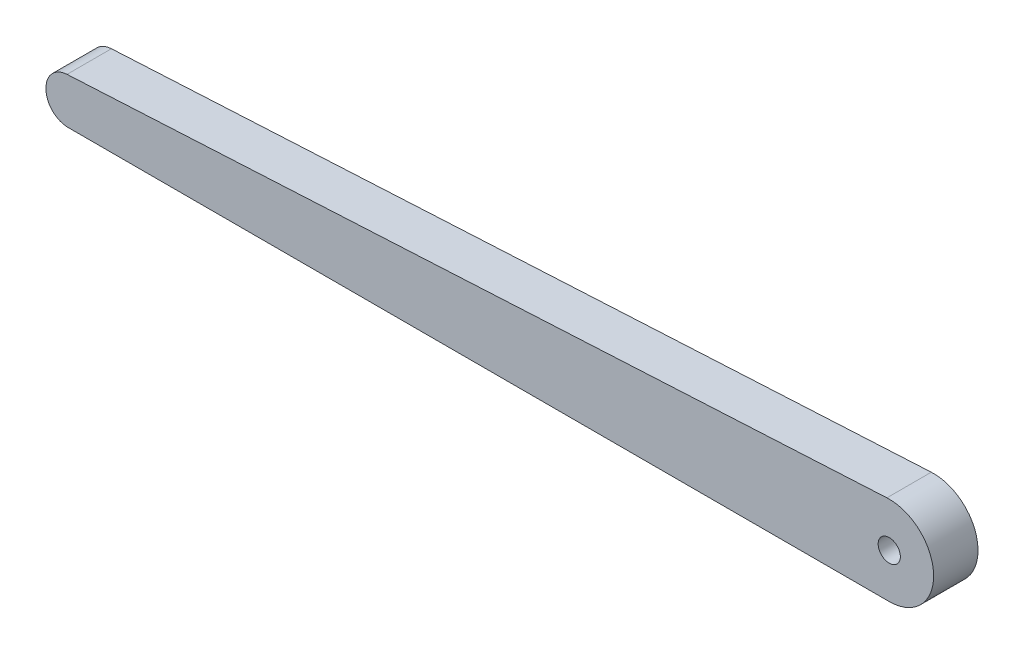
ISO-10303-21;
HEADER;
FILE_DESCRIPTION(('STEP AP214'),'2;1');
FILE_NAME('part.step','',(''),(''),'','','');
FILE_SCHEMA(('AUTOMOTIVE_DESIGN { 1 0 10303 214 1 1 1 1 }'));
ENDSEC;
DATA;
#1=APPLICATION_CONTEXT('core data for automotive mechanical design processes');
#2=APPLICATION_PROTOCOL_DEFINITION('international standard','automotive_design',2000,#1);
#3=PRODUCT_CONTEXT('',#1,'mechanical');
#4=PRODUCT('Part','Part','',(#3));
#5=PRODUCT_RELATED_PRODUCT_CATEGORY('part','',(#4));
#6=PRODUCT_DEFINITION_FORMATION('','',#4);
#7=PRODUCT_DEFINITION_CONTEXT('part definition',#1,'design');
#8=PRODUCT_DEFINITION('design','',#6,#7);
#9=PRODUCT_DEFINITION_SHAPE('','',#8);
#10=(LENGTH_UNIT() NAMED_UNIT(*) SI_UNIT(.MILLI.,.METRE.));
#11=(NAMED_UNIT(*) PLANE_ANGLE_UNIT() SI_UNIT($,.RADIAN.));
#12=(NAMED_UNIT(*) SI_UNIT($,.STERADIAN.) SOLID_ANGLE_UNIT());
#13=UNCERTAINTY_MEASURE_WITH_UNIT(LENGTH_MEASURE(1.E-05),#10,'distance_accuracy_value','');
#14=(GEOMETRIC_REPRESENTATION_CONTEXT(3) GLOBAL_UNCERTAINTY_ASSIGNED_CONTEXT((#13)) GLOBAL_UNIT_ASSIGNED_CONTEXT((#10,
#11,#12)) REPRESENTATION_CONTEXT('',''));
#15=CARTESIAN_POINT('',(0.,0.,0.));
#16=DIRECTION('',(0.,0.,1.));
#17=DIRECTION('',(1.,0.,0.));
#18=AXIS2_PLACEMENT_3D('',#15,#16,#17);
#19=CARTESIAN_POINT('',(0.,0.,1.));
#20=DIRECTION('',(0.,0.,1.));
#21=DIRECTION('',(1.,0.,0.));
#22=AXIS2_PLACEMENT_3D('',#19,#20,#21);
#23=PLANE('',#22);
#24=CARTESIAN_POINT('',(0.,0.,1.));
#25=DIRECTION('',(0.,0.,1.));
#26=DIRECTION('',(1.,0.,0.));
#27=AXIS2_PLACEMENT_3D('',#24,#25,#26);
#28=CIRCLE('',#27,2.);
#29=CARTESIAN_POINT('',(0.,-2.,1.));
#30=VERTEX_POINT('',#29);
#31=CARTESIAN_POINT('',(-0.105263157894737,1.99722799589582,1.));
#32=VERTEX_POINT('',#31);
#33=EDGE_CURVE('E129',#30,#32,#28,.T.);
#34=ORIENTED_EDGE('',*,*,#33,.T.);
#35=DIRECTION('',(-0.998613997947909,-0.0526315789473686,0.));
#36=VECTOR('',#35,1.);
#37=CARTESIAN_POINT('',(-37.0526315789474,0.0499306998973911,1.));
#38=LINE('',#37,#36);
#39=CARTESIAN_POINT('',(-37.0526315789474,0.0499306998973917,1.));
#40=VERTEX_POINT('',#39);
#41=EDGE_CURVE('E87',#32,#40,#38,.T.);
#42=ORIENTED_EDGE('',*,*,#41,.T.);
#43=CARTESIAN_POINT('',(-37.,-0.948683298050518,1.));
#44=DIRECTION('',(0.,0.,1.));
#45=DIRECTION('',(1.,0.,0.));
#46=AXIS2_PLACEMENT_3D('',#43,#44,#45);
#47=CIRCLE('',#46,1.);
#48=CARTESIAN_POINT('',(-38.,-0.948683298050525,1.));
#49=VERTEX_POINT('',#48);
#50=EDGE_CURVE('E100',#40,#49,#47,.T.);
#51=ORIENTED_EDGE('',*,*,#50,.T.);
#52=DIRECTION('',(0.,-1.,0.));
#53=VECTOR('',#52,1.);
#54=CARTESIAN_POINT('',(-38.,-0.999999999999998,1.));
#55=LINE('',#54,#53);
#56=CARTESIAN_POINT('',(-38.,-0.999999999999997,1.));
#57=VERTEX_POINT('',#56);
#58=EDGE_CURVE('E94',#49,#57,#55,.T.);
#59=ORIENTED_EDGE('',*,*,#58,.T.);
#60=CARTESIAN_POINT('',(-37.,-1.,1.));
#61=DIRECTION('',(0.,0.,1.));
#62=DIRECTION('',(-1.,0.,0.));
#63=AXIS2_PLACEMENT_3D('',#60,#61,#62);
#64=CIRCLE('',#63,1.);
#65=CARTESIAN_POINT('',(-37.,-2.,1.));
#66=VERTEX_POINT('',#65);
#67=EDGE_CURVE('E98',#57,#66,#64,.T.);
#68=ORIENTED_EDGE('',*,*,#67,.T.);
#69=DIRECTION('',(1.,0.,0.));
#70=VECTOR('',#69,1.);
#71=CARTESIAN_POINT('',(0.,-2.,1.));
#72=LINE('',#71,#70);
#73=EDGE_CURVE('E50',#66,#30,#72,.T.);
#74=ORIENTED_EDGE('',*,*,#73,.T.);
#75=EDGE_LOOP('',(#34,#42,#51,#59,#68,#74));
#76=FACE_BOUND('',#75,.T.);
#77=CARTESIAN_POINT('',(0.,0.,1.));
#78=DIRECTION('',(0.,0.,1.));
#79=DIRECTION('',(1.,0.,0.));
#80=AXIS2_PLACEMENT_3D('',#77,#78,#79);
#81=CIRCLE('',#80,0.5);
#82=CARTESIAN_POINT('',(0.5,0.,1.));
#83=VERTEX_POINT('',#82);
#84=EDGE_CURVE('E122',#83,#83,#81,.T.);
#85=ORIENTED_EDGE('',*,*,#84,.F.);
#86=EDGE_LOOP('',(#85));
#87=FACE_BOUND('',#86,.T.);
#88=ADVANCED_FACE('F33',(#76,#87),#23,.T.);
#89=CARTESIAN_POINT('',(0.,0.,-1.));
#90=DIRECTION('',(0.,0.,1.));
#91=DIRECTION('',(1.,0.,0.));
#92=AXIS2_PLACEMENT_3D('',#89,#90,#91);
#93=PLANE('',#92);
#94=CARTESIAN_POINT('',(0.,0.,-1.));
#95=DIRECTION('',(0.,0.,1.));
#96=DIRECTION('',(1.,0.,0.));
#97=AXIS2_PLACEMENT_3D('',#94,#95,#96);
#98=CIRCLE('',#97,2.);
#99=CARTESIAN_POINT('',(0.,-2.,-1.));
#100=VERTEX_POINT('',#99);
#101=CARTESIAN_POINT('',(-0.105263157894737,1.99722799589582,-1.));
#102=VERTEX_POINT('',#101);
#103=EDGE_CURVE('E118',#100,#102,#98,.T.);
#104=ORIENTED_EDGE('',*,*,#103,.F.);
#105=DIRECTION('',(1.,0.,0.));
#106=VECTOR('',#105,1.);
#107=CARTESIAN_POINT('',(0.,-2.,-1.));
#108=LINE('',#107,#106);
#109=CARTESIAN_POINT('',(-37.,-2.,-1.));
#110=VERTEX_POINT('',#109);
#111=EDGE_CURVE('E79',#110,#100,#108,.T.);
#112=ORIENTED_EDGE('',*,*,#111,.F.);
#113=CARTESIAN_POINT('',(-37.,-1.,-1.));
#114=DIRECTION('',(0.,0.,1.));
#115=DIRECTION('',(-1.,0.,0.));
#116=AXIS2_PLACEMENT_3D('',#113,#114,#115);
#117=CIRCLE('',#116,1.);
#118=CARTESIAN_POINT('',(-38.,-0.999999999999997,-1.));
#119=VERTEX_POINT('',#118);
#120=EDGE_CURVE('E73',#119,#110,#117,.T.);
#121=ORIENTED_EDGE('',*,*,#120,.F.);
#122=DIRECTION('',(0.,-1.,0.));
#123=VECTOR('',#122,1.);
#124=CARTESIAN_POINT('',(-38.,-0.999999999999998,-1.));
#125=LINE('',#124,#123);
#126=CARTESIAN_POINT('',(-38.,-0.948683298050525,-1.));
#127=VERTEX_POINT('',#126);
#128=EDGE_CURVE('E108',#127,#119,#125,.T.);
#129=ORIENTED_EDGE('',*,*,#128,.F.);
#130=CARTESIAN_POINT('',(-37.,-0.948683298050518,-1.));
#131=DIRECTION('',(0.,0.,1.));
#132=DIRECTION('',(1.,0.,0.));
#133=AXIS2_PLACEMENT_3D('',#130,#131,#132);
#134=CIRCLE('',#133,1.);
#135=CARTESIAN_POINT('',(-37.0526315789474,0.0499306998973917,-1.));
#136=VERTEX_POINT('',#135);
#137=EDGE_CURVE('E124',#136,#127,#134,.T.);
#138=ORIENTED_EDGE('',*,*,#137,.F.);
#139=DIRECTION('',(-0.998613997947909,-0.0526315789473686,0.));
#140=VECTOR('',#139,1.);
#141=CARTESIAN_POINT('',(-37.0526315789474,0.0499306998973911,-1.));
#142=LINE('',#141,#140);
#143=EDGE_CURVE('E121',#102,#136,#142,.T.);
#144=ORIENTED_EDGE('',*,*,#143,.F.);
#145=EDGE_LOOP('',(#104,#112,#121,#129,#138,#144));
#146=FACE_BOUND('',#145,.T.);
#147=CARTESIAN_POINT('',(0.,0.,-1.));
#148=DIRECTION('',(0.,0.,1.));
#149=DIRECTION('',(1.,0.,0.));
#150=AXIS2_PLACEMENT_3D('',#147,#148,#149);
#151=CIRCLE('',#150,0.5);
#152=CARTESIAN_POINT('',(0.5,0.,-1.));
#153=VERTEX_POINT('',#152);
#154=EDGE_CURVE('E222',#153,#153,#151,.T.);
#155=ORIENTED_EDGE('',*,*,#154,.T.);
#156=EDGE_LOOP('',(#155));
#157=FACE_BOUND('',#156,.T.);
#158=ADVANCED_FACE('F138',(#146,#157),#93,.F.);
#159=CARTESIAN_POINT('',(0.,0.,1.));
#160=DIRECTION('',(0.,0.,-1.));
#161=DIRECTION('',(-1.,0.,0.));
#162=AXIS2_PLACEMENT_3D('',#159,#160,#161);
#163=CYLINDRICAL_SURFACE('',#162,2.);
#164=ORIENTED_EDGE('',*,*,#103,.T.);
#165=DIRECTION('',(0.,0.,-1.));
#166=VECTOR('',#165,1.);
#167=CARTESIAN_POINT('',(-0.105263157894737,1.99722799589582,1.));
#168=LINE('',#167,#166);
#169=EDGE_CURVE('E11',#32,#102,#168,.T.);
#170=ORIENTED_EDGE('',*,*,#169,.F.);
#171=ORIENTED_EDGE('',*,*,#33,.F.);
#172=DIRECTION('',(0.,0.,-1.));
#173=VECTOR('',#172,1.);
#174=CARTESIAN_POINT('',(0.,-2.,1.));
#175=LINE('',#174,#173);
#176=EDGE_CURVE('E114',#30,#100,#175,.T.);
#177=ORIENTED_EDGE('',*,*,#176,.T.);
#178=EDGE_LOOP('',(#164,#170,#171,#177));
#179=FACE_BOUND('',#178,.T.);
#180=ADVANCED_FACE('F35',(#179),#163,.T.);
#181=CARTESIAN_POINT('',(-37.0526315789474,0.0499306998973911,1.));
#182=DIRECTION('',(0.0526315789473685,-0.998613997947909,0.));
#183=DIRECTION('',(0.998613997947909,0.0526315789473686,0.));
#184=AXIS2_PLACEMENT_3D('',#181,#182,#183);
#185=PLANE('',#184);
#186=ORIENTED_EDGE('',*,*,#143,.T.);
#187=DIRECTION('',(0.,0.,-1.));
#188=VECTOR('',#187,1.);
#189=CARTESIAN_POINT('',(-37.0526315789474,0.0499306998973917,1.));
#190=LINE('',#189,#188);
#191=EDGE_CURVE('E42',#40,#136,#190,.T.);
#192=ORIENTED_EDGE('',*,*,#191,.F.);
#193=ORIENTED_EDGE('',*,*,#41,.F.);
#194=ORIENTED_EDGE('',*,*,#169,.T.);
#195=EDGE_LOOP('',(#186,#192,#193,#194));
#196=FACE_BOUND('',#195,.T.);
#197=ADVANCED_FACE('F163',(#196),#185,.F.);
#198=CARTESIAN_POINT('',(-37.,-0.948683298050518,1.));
#199=DIRECTION('',(0.,0.,-1.));
#200=DIRECTION('',(-1.,0.,0.));
#201=AXIS2_PLACEMENT_3D('',#198,#199,#200);
#202=CYLINDRICAL_SURFACE('',#201,1.);
#203=ORIENTED_EDGE('',*,*,#137,.T.);
#204=DIRECTION('',(0.,0.,-1.));
#205=VECTOR('',#204,1.);
#206=CARTESIAN_POINT('',(-38.,-0.948683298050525,1.));
#207=LINE('',#206,#205);
#208=EDGE_CURVE('E109',#49,#127,#207,.T.);
#209=ORIENTED_EDGE('',*,*,#208,.F.);
#210=ORIENTED_EDGE('',*,*,#50,.F.);
#211=ORIENTED_EDGE('',*,*,#191,.T.);
#212=EDGE_LOOP('',(#203,#209,#210,#211));
#213=FACE_BOUND('',#212,.T.);
#214=ADVANCED_FACE('F135',(#213),#202,.T.);
#215=CARTESIAN_POINT('',(-38.,-0.999999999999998,1.));
#216=DIRECTION('',(1.,0.,0.));
#217=DIRECTION('',(0.,0.,-1.));
#218=AXIS2_PLACEMENT_3D('',#215,#216,#217);
#219=PLANE('',#218);
#220=ORIENTED_EDGE('',*,*,#128,.T.);
#221=DIRECTION('',(0.,0.,-1.));
#222=VECTOR('',#221,1.);
#223=CARTESIAN_POINT('',(-38.,-0.999999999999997,1.));
#224=LINE('',#223,#222);
#225=EDGE_CURVE('E105',#57,#119,#224,.T.);
#226=ORIENTED_EDGE('',*,*,#225,.F.);
#227=ORIENTED_EDGE('',*,*,#58,.F.);
#228=ORIENTED_EDGE('',*,*,#208,.T.);
#229=EDGE_LOOP('',(#220,#226,#227,#228));
#230=FACE_BOUND('',#229,.T.);
#231=ADVANCED_FACE('F106',(#230),#219,.F.);
#232=CARTESIAN_POINT('',(-37.,-1.,1.));
#233=DIRECTION('',(0.,0.,-1.));
#234=DIRECTION('',(-1.,0.,0.));
#235=AXIS2_PLACEMENT_3D('',#232,#233,#234);
#236=CYLINDRICAL_SURFACE('',#235,1.);
#237=ORIENTED_EDGE('',*,*,#120,.T.);
#238=DIRECTION('',(0.,0.,-1.));
#239=VECTOR('',#238,1.);
#240=CARTESIAN_POINT('',(-37.,-2.,1.));
#241=LINE('',#240,#239);
#242=EDGE_CURVE('E110',#66,#110,#241,.T.);
#243=ORIENTED_EDGE('',*,*,#242,.F.);
#244=ORIENTED_EDGE('',*,*,#67,.F.);
#245=ORIENTED_EDGE('',*,*,#225,.T.);
#246=EDGE_LOOP('',(#237,#243,#244,#245));
#247=FACE_BOUND('',#246,.T.);
#248=ADVANCED_FACE('F112',(#247),#236,.T.);
#249=CARTESIAN_POINT('',(0.,-2.,1.));
#250=DIRECTION('',(0.,1.,0.));
#251=DIRECTION('',(-1.,0.,0.));
#252=AXIS2_PLACEMENT_3D('',#249,#250,#251);
#253=PLANE('',#252);
#254=ORIENTED_EDGE('',*,*,#111,.T.);
#255=ORIENTED_EDGE('',*,*,#176,.F.);
#256=ORIENTED_EDGE('',*,*,#73,.F.);
#257=ORIENTED_EDGE('',*,*,#242,.T.);
#258=EDGE_LOOP('',(#254,#255,#256,#257));
#259=FACE_BOUND('',#258,.T.);
#260=ADVANCED_FACE('F143',(#259),#253,.F.);
#261=CARTESIAN_POINT('',(0.,0.,1.));
#262=DIRECTION('',(0.,0.,-1.));
#263=DIRECTION('',(-1.,0.,0.));
#264=AXIS2_PLACEMENT_3D('',#261,#262,#263);
#265=CYLINDRICAL_SURFACE('',#264,0.5);
#266=ORIENTED_EDGE('',*,*,#84,.T.);
#267=EDGE_LOOP('',(#266));
#268=FACE_BOUND('',#267,.T.);
#269=ORIENTED_EDGE('',*,*,#154,.F.);
#270=EDGE_LOOP('',(#269));
#271=FACE_BOUND('',#270,.T.);
#272=ADVANCED_FACE('F145',(#268,#271),#265,.F.);
#273=CLOSED_SHELL('',(#88,#158,#180,#197,#214,#231,#248,#260,#272));
#274=MANIFOLD_SOLID_BREP('B2',#273);
#275=ADVANCED_BREP_SHAPE_REPRESENTATION('',(#18,#274),#14);
#276=SHAPE_DEFINITION_REPRESENTATION(#9,#275);
ENDSEC;
END-ISO-10303-21;
